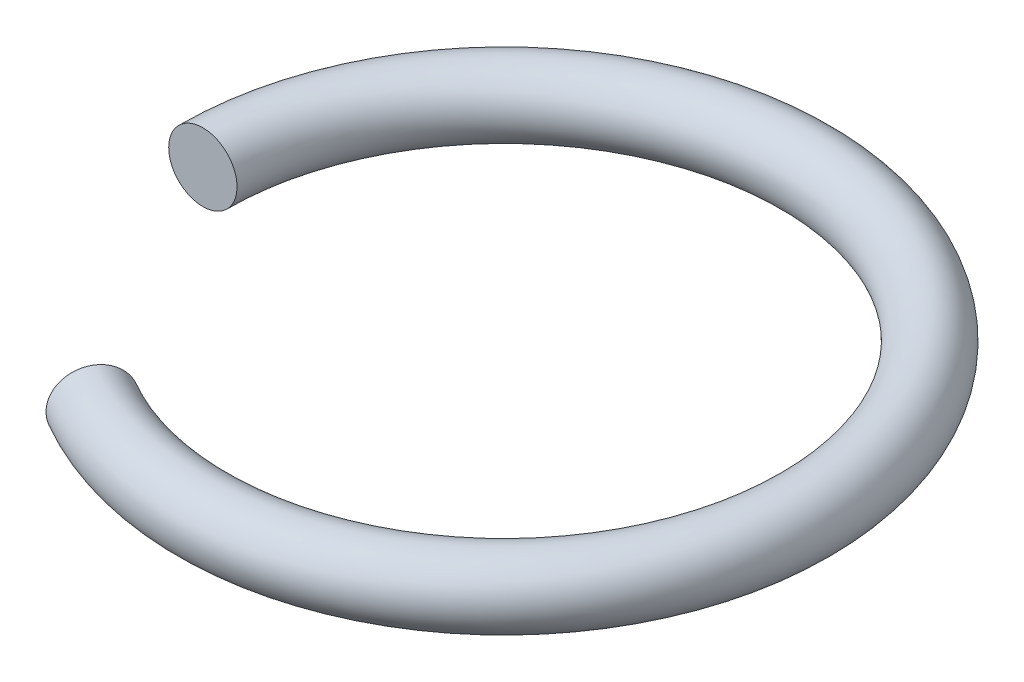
from build123d import *

# Parameters (mm, degrees)
ESQUISSE1_R       = 0.775
R_VOLUTION1_ANGLE = 300


with BuildPart() as part:
    # Esquisse1 → R_volution1 (revolve)
    with BuildSketch(Plane.XY):
        with Locations((-6.83, -18.525)):
            Circle(ESQUISSE1_R)
    revolve(axis=Axis((0, 0, 0), (0, -1, 0)), revolution_arc=R_VOLUTION1_ANGLE)


solid = part.part
